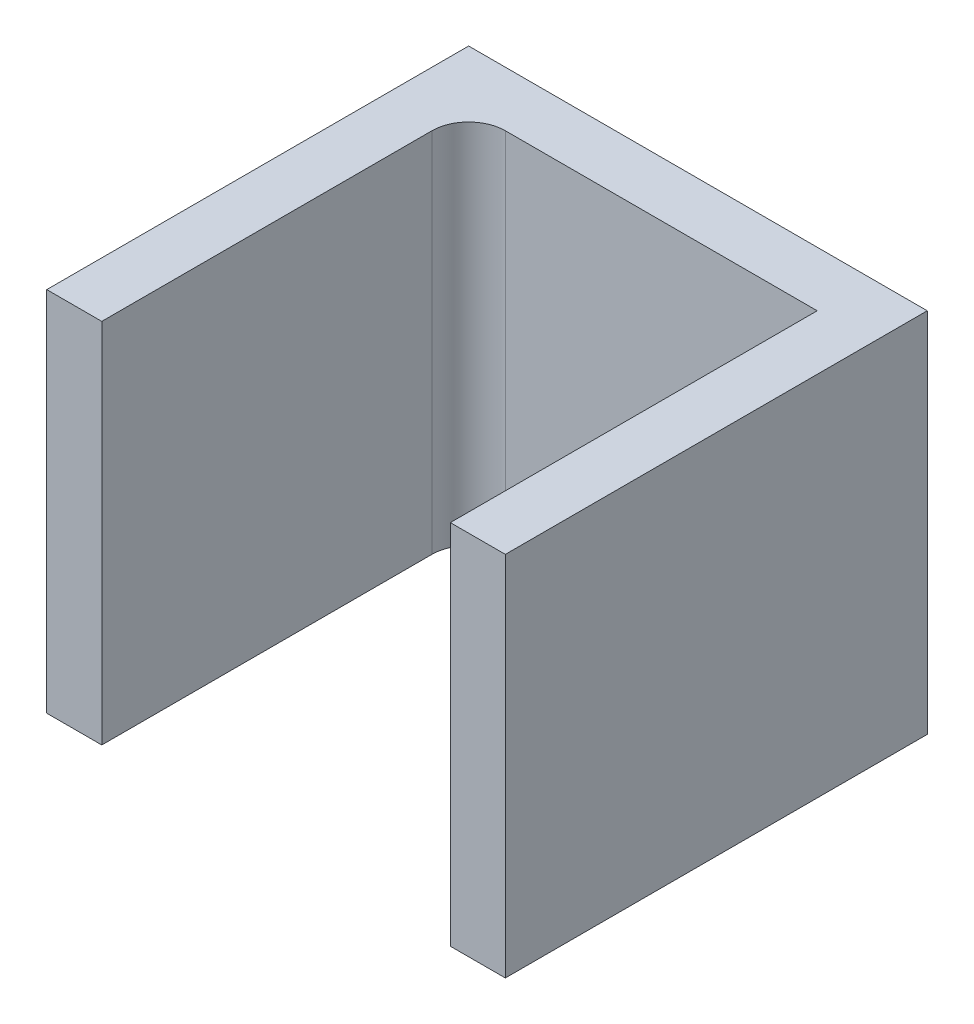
from build123d import *

# Parameters (mm, degrees)
BOSS_EXTRU_1_DEPTH = 20
CONG_1_R           = 2


with BuildPart() as part:
    # Esquisse1 → Boss.-Extru.1 (new body)
    with BuildSketch(Plane(origin=(0, 0, 0), x_dir=(1, 0, 0), z_dir=(0, 1, 0))):
        Polygon((-5.708737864, 0), (-5.708737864, 20), (13.291262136, 20), (13.291262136, 0), (16.291262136, 0), (16.291262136, 23), (-8.708737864, 23), (-8.708737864, 0), align=None)
    extrude(amount=BOSS_EXTRU_1_DEPTH)

    # Cong_1
    cong_1_edges = [part.edges().sort_by_distance(p)[0] for p in [
        (-5.708737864, 10, -20),
    ]]
    fillet(cong_1_edges, radius=CONG_1_R)


solid = part.part
